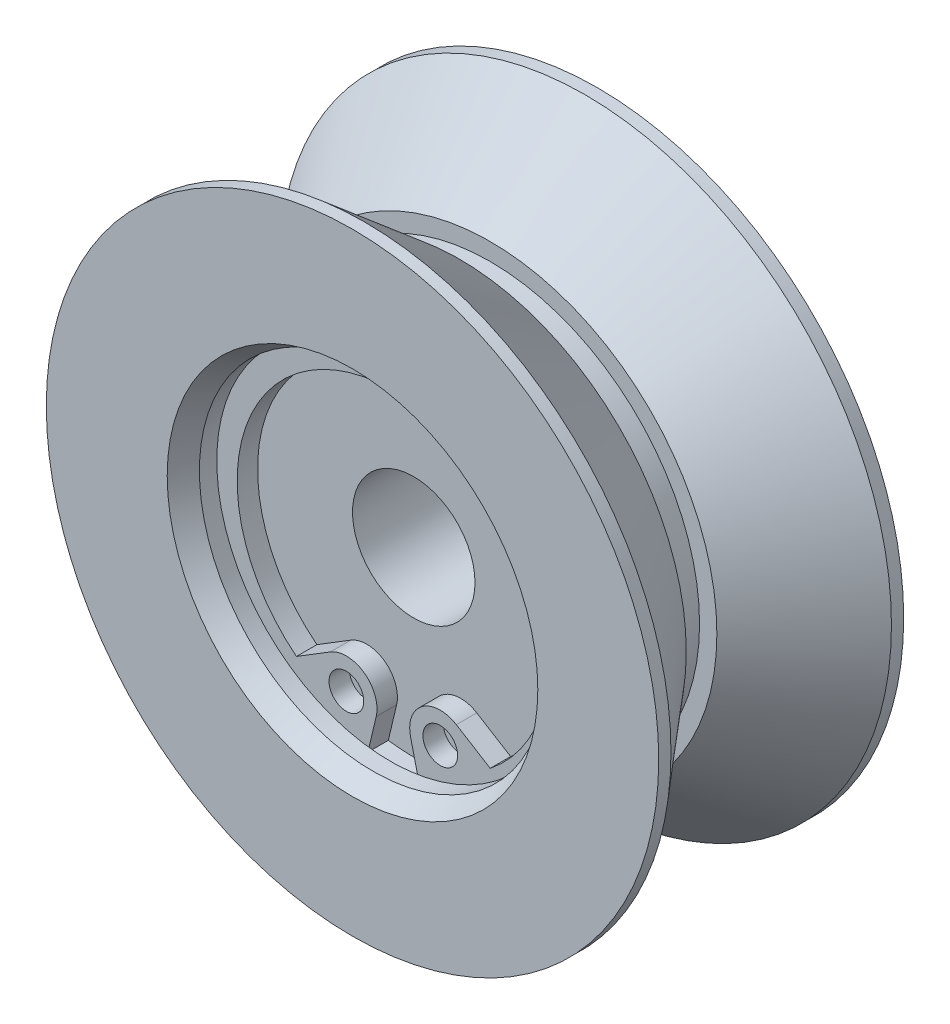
ISO-10303-21;
HEADER;
FILE_DESCRIPTION(('STEP AP214'),'2;1');
FILE_NAME('part.step','',(''),(''),'','','');
FILE_SCHEMA(('AUTOMOTIVE_DESIGN { 1 0 10303 214 1 1 1 1 }'));
ENDSEC;
DATA;
#1=APPLICATION_CONTEXT('core data for automotive mechanical design processes');
#2=APPLICATION_PROTOCOL_DEFINITION('international standard','automotive_design',2000,#1);
#3=PRODUCT_CONTEXT('',#1,'mechanical');
#4=PRODUCT('Part','Part','',(#3));
#5=PRODUCT_RELATED_PRODUCT_CATEGORY('part','',(#4));
#6=PRODUCT_DEFINITION_FORMATION('','',#4);
#7=PRODUCT_DEFINITION_CONTEXT('part definition',#1,'design');
#8=PRODUCT_DEFINITION('design','',#6,#7);
#9=PRODUCT_DEFINITION_SHAPE('','',#8);
#10=(LENGTH_UNIT() NAMED_UNIT(*) SI_UNIT(.MILLI.,.METRE.));
#11=(NAMED_UNIT(*) PLANE_ANGLE_UNIT() SI_UNIT($,.RADIAN.));
#12=(NAMED_UNIT(*) SI_UNIT($,.STERADIAN.) SOLID_ANGLE_UNIT());
#13=UNCERTAINTY_MEASURE_WITH_UNIT(LENGTH_MEASURE(1.E-05),#10,'distance_accuracy_value','');
#14=(GEOMETRIC_REPRESENTATION_CONTEXT(3) GLOBAL_UNCERTAINTY_ASSIGNED_CONTEXT((#13)) GLOBAL_UNIT_ASSIGNED_CONTEXT((#10,
#11,#12)) REPRESENTATION_CONTEXT('',''));
#15=CARTESIAN_POINT('',(0.,0.,0.));
#16=DIRECTION('',(0.,0.,1.));
#17=DIRECTION('',(1.,0.,0.));
#18=AXIS2_PLACEMENT_3D('',#15,#16,#17);
#19=CARTESIAN_POINT('',(0.,-0.5,4.));
#20=DIRECTION('',(0.,0.,1.));
#21=DIRECTION('',(-1.,0.,0.));
#22=AXIS2_PLACEMENT_3D('',#19,#20,#21);
#23=CYLINDRICAL_SURFACE('',#22,7.65);
#24=CARTESIAN_POINT('',(0.,-0.5,3.));
#25=DIRECTION('',(0.,0.,-1.));
#26=DIRECTION('',(0.,-1.,0.));
#27=AXIS2_PLACEMENT_3D('',#24,#25,#26);
#28=CIRCLE('',#27,7.65);
#29=CARTESIAN_POINT('',(-4.74513893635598,-6.50051301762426,3.));
#30=VERTEX_POINT('',#29);
#31=CARTESIAN_POINT('',(4.74513893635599,-6.50051301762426,3.));
#32=VERTEX_POINT('',#31);
#33=EDGE_CURVE('E110',#30,#32,#28,.T.);
#34=ORIENTED_EDGE('',*,*,#33,.T.);
#35=DIRECTION('',(0.,0.,-1.));
#36=VECTOR('',#35,1.);
#37=CARTESIAN_POINT('',(4.74513893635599,-6.50051301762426,4.));
#38=LINE('',#37,#36);
#39=CARTESIAN_POINT('',(4.74513893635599,-6.50051301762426,4.));
#40=VERTEX_POINT('',#39);
#41=EDGE_CURVE('E136',#40,#32,#38,.T.);
#42=ORIENTED_EDGE('',*,*,#41,.F.);
#43=CARTESIAN_POINT('',(0.,-0.5,4.));
#44=DIRECTION('',(0.,0.,-1.));
#45=DIRECTION('',(0.,-1.,0.));
#46=AXIS2_PLACEMENT_3D('',#43,#44,#45);
#47=CIRCLE('',#46,7.65);
#48=CARTESIAN_POINT('',(-4.74513893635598,-6.50051301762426,4.));
#49=VERTEX_POINT('',#48);
#50=EDGE_CURVE('E137',#49,#40,#47,.T.);
#51=ORIENTED_EDGE('',*,*,#50,.F.);
#52=DIRECTION('',(0.,0.,-1.));
#53=VECTOR('',#52,1.);
#54=CARTESIAN_POINT('',(-4.74513893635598,-6.50051301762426,4.));
#55=LINE('',#54,#53);
#56=EDGE_CURVE('E165',#49,#30,#55,.T.);
#57=ORIENTED_EDGE('',*,*,#56,.T.);
#58=EDGE_LOOP('',(#34,#42,#51,#57));
#59=FACE_BOUND('',#58,.T.);
#60=ADVANCED_FACE('F14',(#59),#23,.F.);
#61=CARTESIAN_POINT('',(3.08650226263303,-5.47917588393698,4.));
#62=DIRECTION('',(-0.524334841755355,-0.851512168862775,0.));
#63=DIRECTION('',(-0.851512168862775,0.524334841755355,0.));
#64=AXIS2_PLACEMENT_3D('',#61,#62,#63);
#65=PLANE('',#64);
#66=DIRECTION('',(-0.851512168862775,0.524334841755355,0.));
#67=VECTOR('',#66,1.);
#68=CARTESIAN_POINT('',(3.08650226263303,-5.47917588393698,3.));
#69=LINE('',#68,#67);
#70=CARTESIAN_POINT('',(3.08650226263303,-5.47917588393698,3.));
#71=VERTEX_POINT('',#70);
#72=EDGE_CURVE('E150',#32,#71,#69,.T.);
#73=ORIENTED_EDGE('',*,*,#72,.T.);
#74=DIRECTION('',(0.,0.,-1.));
#75=VECTOR('',#74,1.);
#76=CARTESIAN_POINT('',(3.08650226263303,-5.47917588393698,4.));
#77=LINE('',#76,#75);
#78=CARTESIAN_POINT('',(3.08650226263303,-5.47917588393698,4.));
#79=VERTEX_POINT('',#78);
#80=EDGE_CURVE('E145',#79,#71,#77,.T.);
#81=ORIENTED_EDGE('',*,*,#80,.F.);
#82=DIRECTION('',(-0.851512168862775,0.524334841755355,0.));
#83=VECTOR('',#82,1.);
#84=CARTESIAN_POINT('',(3.08650226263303,-5.47917588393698,4.));
#85=LINE('',#84,#83);
#86=EDGE_CURVE('E155',#40,#79,#85,.T.);
#87=ORIENTED_EDGE('',*,*,#86,.F.);
#88=ORIENTED_EDGE('',*,*,#41,.T.);
#89=EDGE_LOOP('',(#73,#81,#87,#88));
#90=FACE_BOUND('',#89,.T.);
#91=ADVANCED_FACE('F304',(#90),#65,.F.);
#92=CARTESIAN_POINT('',(2.3,-6.75644413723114,4.));
#93=DIRECTION('',(0.,0.,1.));
#94=DIRECTION('',(-1.,0.,0.));
#95=AXIS2_PLACEMENT_3D('',#92,#93,#94);
#96=CYLINDRICAL_SURFACE('',#95,1.5);
#97=CARTESIAN_POINT('',(2.3,-6.75644413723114,3.));
#98=DIRECTION('',(0.,0.,1.));
#99=DIRECTION('',(1.,0.,0.));
#100=AXIS2_PLACEMENT_3D('',#97,#98,#99);
#101=CIRCLE('',#100,1.5);
#102=CARTESIAN_POINT('',(0.840693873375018,-7.10346809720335,3.));
#103=VERTEX_POINT('',#102);
#104=EDGE_CURVE('E160',#71,#103,#101,.T.);
#105=ORIENTED_EDGE('',*,*,#104,.T.);
#106=DIRECTION('',(0.,0.,-1.));
#107=VECTOR('',#106,1.);
#108=CARTESIAN_POINT('',(0.840693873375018,-7.10346809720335,4.));
#109=LINE('',#108,#107);
#110=CARTESIAN_POINT('',(0.840693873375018,-7.10346809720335,4.));
#111=VERTEX_POINT('',#110);
#112=EDGE_CURVE('E146',#111,#103,#109,.T.);
#113=ORIENTED_EDGE('',*,*,#112,.F.);
#114=CARTESIAN_POINT('',(2.3,-6.75644413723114,4.));
#115=DIRECTION('',(0.,0.,1.));
#116=DIRECTION('',(1.,0.,0.));
#117=AXIS2_PLACEMENT_3D('',#114,#115,#116);
#118=CIRCLE('',#117,1.5);
#119=EDGE_CURVE('E151',#79,#111,#118,.T.);
#120=ORIENTED_EDGE('',*,*,#119,.F.);
#121=ORIENTED_EDGE('',*,*,#80,.T.);
#122=EDGE_LOOP('',(#105,#113,#120,#121));
#123=FACE_BOUND('',#122,.T.);
#124=ADVANCED_FACE('F250',(#123),#96,.T.);
#125=CARTESIAN_POINT('',(-0.84069387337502,-7.10346809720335,4.));
#126=DIRECTION('',(-0.97287075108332,0.231349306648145,0.));
#127=DIRECTION('',(0.,0.,1.));
#128=AXIS2_PLACEMENT_3D('',#125,#126,#127);
#129=PLANE('',#128);
#130=DIRECTION('',(0.,0.,1.));
#131=VECTOR('',#130,1.);
#132=CARTESIAN_POINT('',(-1.24703201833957,-8.81220240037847,8.6342229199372));
#133=LINE('',#132,#131);
#134=CARTESIAN_POINT('',(-1.24703201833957,-8.81220240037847,3.));
#135=VERTEX_POINT('',#134);
#136=CARTESIAN_POINT('',(-1.24703201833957,-8.81220240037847,4.));
#137=VERTEX_POINT('',#136);
#138=EDGE_CURVE('E115',#135,#137,#133,.T.);
#139=ORIENTED_EDGE('',*,*,#138,.F.);
#140=DIRECTION('',(0.231349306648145,0.97287075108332,0.));
#141=VECTOR('',#140,1.);
#142=CARTESIAN_POINT('',(-0.84069387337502,-7.10346809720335,3.));
#143=LINE('',#142,#141);
#144=CARTESIAN_POINT('',(-0.84069387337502,-7.10346809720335,3.));
#145=VERTEX_POINT('',#144);
#146=EDGE_CURVE('E103',#135,#145,#143,.T.);
#147=ORIENTED_EDGE('',*,*,#146,.T.);
#148=DIRECTION('',(0.,0.,-1.));
#149=VECTOR('',#148,1.);
#150=CARTESIAN_POINT('',(-0.84069387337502,-7.10346809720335,4.));
#151=LINE('',#150,#149);
#152=CARTESIAN_POINT('',(-0.84069387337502,-7.10346809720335,4.));
#153=VERTEX_POINT('',#152);
#154=EDGE_CURVE('E99',#153,#145,#151,.T.);
#155=ORIENTED_EDGE('',*,*,#154,.F.);
#156=DIRECTION('',(0.231349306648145,0.97287075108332,0.));
#157=VECTOR('',#156,1.);
#158=CARTESIAN_POINT('',(-0.84069387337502,-7.10346809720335,4.));
#159=LINE('',#158,#157);
#160=EDGE_CURVE('E141',#137,#153,#159,.T.);
#161=ORIENTED_EDGE('',*,*,#160,.F.);
#162=EDGE_LOOP('',(#139,#147,#155,#161));
#163=FACE_BOUND('',#162,.T.);
#164=ADVANCED_FACE('F271',(#163),#129,.F.);
#165=CARTESIAN_POINT('',(0.,-0.5,4.));
#166=DIRECTION('',(0.,0.,-1.));
#167=DIRECTION('',(0.,-1.,0.));
#168=AXIS2_PLACEMENT_3D('',#165,#166,#167);
#169=PLANE('',#168);
#170=CARTESIAN_POINT('',(2.3,-6.75644413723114,4.));
#171=DIRECTION('',(0.,0.,1.));
#172=DIRECTION('',(1.,0.,0.));
#173=AXIS2_PLACEMENT_3D('',#170,#171,#172);
#174=CIRCLE('',#173,0.85);
#175=CARTESIAN_POINT('',(3.15,-6.75644413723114,4.));
#176=VERTEX_POINT('',#175);
#177=EDGE_CURVE('E130',#176,#176,#174,.T.);
#178=ORIENTED_EDGE('',*,*,#177,.F.);
#179=EDGE_LOOP('',(#178));
#180=FACE_BOUND('',#179,.T.);
#181=CARTESIAN_POINT('',(-2.3,-6.75644413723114,4.));
#182=DIRECTION('',(0.,0.,-1.));
#183=DIRECTION('',(1.,0.,0.));
#184=AXIS2_PLACEMENT_3D('',#181,#182,#183);
#185=CIRCLE('',#184,0.85);
#186=CARTESIAN_POINT('',(-1.45,-6.75644413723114,4.));
#187=VERTEX_POINT('',#186);
#188=EDGE_CURVE('E142',#187,#187,#185,.T.);
#189=ORIENTED_EDGE('',*,*,#188,.T.);
#190=EDGE_LOOP('',(#189));
#191=FACE_BOUND('',#190,.T.);
#192=CARTESIAN_POINT('',(0.,0.,4.));
#193=DIRECTION('',(0.,0.,-1.));
#194=DIRECTION('',(-1.,0.,0.));
#195=AXIS2_PLACEMENT_3D('',#192,#193,#194);
#196=CIRCLE('',#195,8.9);
#197=CARTESIAN_POINT('',(1.24703201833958,-8.81220240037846,4.));
#198=VERTEX_POINT('',#197);
#199=EDGE_CURVE('E9',#137,#198,#196,.T.);
#200=ORIENTED_EDGE('',*,*,#199,.F.);
#201=ORIENTED_EDGE('',*,*,#160,.T.);
#202=CARTESIAN_POINT('',(-2.3,-6.75644413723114,4.));
#203=DIRECTION('',(0.,0.,1.));
#204=DIRECTION('',(-1.,0.,0.));
#205=AXIS2_PLACEMENT_3D('',#202,#203,#204);
#206=CIRCLE('',#205,1.5);
#207=CARTESIAN_POINT('',(-3.08650226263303,-5.47917588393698,4.));
#208=VERTEX_POINT('',#207);
#209=EDGE_CURVE('E138',#153,#208,#206,.T.);
#210=ORIENTED_EDGE('',*,*,#209,.T.);
#211=DIRECTION('',(-0.851512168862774,-0.524334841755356,0.));
#212=VECTOR('',#211,1.);
#213=CARTESIAN_POINT('',(-3.08650226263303,-5.47917588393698,4.));
#214=LINE('',#213,#212);
#215=EDGE_CURVE('E118',#208,#49,#214,.T.);
#216=ORIENTED_EDGE('',*,*,#215,.T.);
#217=ORIENTED_EDGE('',*,*,#50,.T.);
#218=ORIENTED_EDGE('',*,*,#86,.T.);
#219=ORIENTED_EDGE('',*,*,#119,.T.);
#220=DIRECTION('',(0.231349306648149,-0.972870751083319,0.));
#221=VECTOR('',#220,1.);
#222=CARTESIAN_POINT('',(0.840693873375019,-7.10346809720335,4.));
#223=LINE('',#222,#221);
#224=EDGE_CURVE('E156',#111,#198,#223,.T.);
#225=ORIENTED_EDGE('',*,*,#224,.T.);
#226=EDGE_LOOP('',(#200,#201,#210,#216,#217,#218,#219,#225));
#227=FACE_BOUND('',#226,.T.);
#228=ADVANCED_FACE('F267',(#180,#191,#227),#169,.F.);
#229=CARTESIAN_POINT('',(2.3,-6.75644413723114,4.));
#230=DIRECTION('',(0.,0.,1.));
#231=DIRECTION('',(-1.,0.,0.));
#232=AXIS2_PLACEMENT_3D('',#229,#230,#231);
#233=CYLINDRICAL_SURFACE('',#232,0.85);
#234=CARTESIAN_POINT('',(2.3,-6.75644413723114,3.));
#235=DIRECTION('',(0.,0.,1.));
#236=DIRECTION('',(1.,0.,0.));
#237=AXIS2_PLACEMENT_3D('',#234,#235,#236);
#238=CIRCLE('',#237,0.85);
#239=CARTESIAN_POINT('',(3.15,-6.75644413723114,3.));
#240=VERTEX_POINT('',#239);
#241=EDGE_CURVE('E120',#240,#240,#238,.T.);
#242=ORIENTED_EDGE('',*,*,#241,.F.);
#243=EDGE_LOOP('',(#242));
#244=FACE_BOUND('',#243,.T.);
#245=ORIENTED_EDGE('',*,*,#177,.T.);
#246=EDGE_LOOP('',(#245));
#247=FACE_BOUND('',#246,.T.);
#248=ADVANCED_FACE('F316',(#244,#247),#233,.F.);
#249=CARTESIAN_POINT('',(-2.3,-6.75644413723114,4.));
#250=DIRECTION('',(0.,0.,1.));
#251=DIRECTION('',(-1.,0.,0.));
#252=AXIS2_PLACEMENT_3D('',#249,#250,#251);
#253=CYLINDRICAL_SURFACE('',#252,0.85);
#254=CARTESIAN_POINT('',(-2.3,-6.75644413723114,3.));
#255=DIRECTION('',(0.,0.,-1.));
#256=DIRECTION('',(1.,0.,0.));
#257=AXIS2_PLACEMENT_3D('',#254,#255,#256);
#258=CIRCLE('',#257,0.85);
#259=CARTESIAN_POINT('',(-1.45,-6.75644413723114,3.));
#260=VERTEX_POINT('',#259);
#261=EDGE_CURVE('E133',#260,#260,#258,.T.);
#262=ORIENTED_EDGE('',*,*,#261,.T.);
#263=EDGE_LOOP('',(#262));
#264=FACE_BOUND('',#263,.T.);
#265=ORIENTED_EDGE('',*,*,#188,.F.);
#266=EDGE_LOOP('',(#265));
#267=FACE_BOUND('',#266,.T.);
#268=ADVANCED_FACE('F506',(#264,#267),#253,.F.);
#269=CARTESIAN_POINT('',(-3.08650226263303,-5.47917588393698,4.));
#270=DIRECTION('',(0.524334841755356,-0.851512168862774,0.));
#271=DIRECTION('',(0.,0.,-1.));
#272=AXIS2_PLACEMENT_3D('',#269,#270,#271);
#273=PLANE('',#272);
#274=DIRECTION('',(-0.851512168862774,-0.524334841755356,0.));
#275=VECTOR('',#274,1.);
#276=CARTESIAN_POINT('',(-3.08650226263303,-5.47917588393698,3.));
#277=LINE('',#276,#275);
#278=CARTESIAN_POINT('',(-3.08650226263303,-5.47917588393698,3.));
#279=VERTEX_POINT('',#278);
#280=EDGE_CURVE('E106',#279,#30,#277,.T.);
#281=ORIENTED_EDGE('',*,*,#280,.T.);
#282=ORIENTED_EDGE('',*,*,#56,.F.);
#283=ORIENTED_EDGE('',*,*,#215,.F.);
#284=DIRECTION('',(0.,0.,-1.));
#285=VECTOR('',#284,1.);
#286=CARTESIAN_POINT('',(-3.08650226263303,-5.47917588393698,4.));
#287=LINE('',#286,#285);
#288=EDGE_CURVE('E96',#208,#279,#287,.T.);
#289=ORIENTED_EDGE('',*,*,#288,.T.);
#290=EDGE_LOOP('',(#281,#282,#283,#289));
#291=FACE_BOUND('',#290,.T.);
#292=ADVANCED_FACE('F117',(#291),#273,.F.);
#293=CARTESIAN_POINT('',(-2.3,-6.75644413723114,4.));
#294=DIRECTION('',(0.,0.,1.));
#295=DIRECTION('',(-1.,0.,0.));
#296=AXIS2_PLACEMENT_3D('',#293,#294,#295);
#297=CYLINDRICAL_SURFACE('',#296,1.5);
#298=CARTESIAN_POINT('',(-2.3,-6.75644413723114,3.));
#299=DIRECTION('',(0.,0.,1.));
#300=DIRECTION('',(-1.,0.,0.));
#301=AXIS2_PLACEMENT_3D('',#298,#299,#300);
#302=CIRCLE('',#301,1.5);
#303=EDGE_CURVE('E91',#145,#279,#302,.T.);
#304=ORIENTED_EDGE('',*,*,#303,.T.);
#305=ORIENTED_EDGE('',*,*,#288,.F.);
#306=ORIENTED_EDGE('',*,*,#209,.F.);
#307=ORIENTED_EDGE('',*,*,#154,.T.);
#308=EDGE_LOOP('',(#304,#305,#306,#307));
#309=FACE_BOUND('',#308,.T.);
#310=ADVANCED_FACE('F93',(#309),#297,.T.);
#311=CARTESIAN_POINT('',(0.840693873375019,-7.10346809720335,4.));
#312=DIRECTION('',(0.972870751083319,0.231349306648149,0.));
#313=DIRECTION('',(0.,0.,-1.));
#314=AXIS2_PLACEMENT_3D('',#311,#312,#313);
#315=PLANE('',#314);
#316=DIRECTION('',(0.,0.,1.));
#317=VECTOR('',#316,1.);
#318=CARTESIAN_POINT('',(1.24703201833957,-8.81220240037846,8.6342229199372));
#319=LINE('',#318,#317);
#320=CARTESIAN_POINT('',(1.24703201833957,-8.81220240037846,3.));
#321=VERTEX_POINT('',#320);
#322=EDGE_CURVE('E18',#198,#321,#319,.F.);
#323=ORIENTED_EDGE('',*,*,#322,.F.);
#324=ORIENTED_EDGE('',*,*,#224,.F.);
#325=ORIENTED_EDGE('',*,*,#112,.T.);
#326=DIRECTION('',(0.231349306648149,-0.972870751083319,0.));
#327=VECTOR('',#326,1.);
#328=CARTESIAN_POINT('',(0.840693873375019,-7.10346809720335,3.));
#329=LINE('',#328,#327);
#330=EDGE_CURVE('E32',#103,#321,#329,.T.);
#331=ORIENTED_EDGE('',*,*,#330,.T.);
#332=EDGE_LOOP('',(#323,#324,#325,#331));
#333=FACE_BOUND('',#332,.T.);
#334=ADVANCED_FACE('F253',(#333),#315,.F.);
#335=CARTESIAN_POINT('',(0.,3.,3.));
#336=DIRECTION('',(0.,0.,-1.));
#337=DIRECTION('',(-1.,0.,0.));
#338=AXIS2_PLACEMENT_3D('',#335,#336,#337);
#339=PLANE('',#338);
#340=ORIENTED_EDGE('',*,*,#241,.T.);
#341=EDGE_LOOP('',(#340));
#342=FACE_BOUND('',#341,.T.);
#343=ADVANCED_FACE('F290',(#342),#339,.F.);
#344=ORIENTED_EDGE('',*,*,#261,.F.);
#345=EDGE_LOOP('',(#344));
#346=FACE_BOUND('',#345,.T.);
#347=ADVANCED_FACE('F292',(#346),#339,.F.);
#348=CARTESIAN_POINT('',(0.,0.,8.6342229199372));
#349=DIRECTION('',(0.,0.,1.));
#350=DIRECTION('',(1.,0.,0.));
#351=AXIS2_PLACEMENT_3D('',#348,#349,#350);
#352=CYLINDRICAL_SURFACE('',#351,10.25);
#353=CARTESIAN_POINT('',(0.,0.,0.75));
#354=DIRECTION('',(0.,0.,1.));
#355=DIRECTION('',(1.,0.,0.));
#356=AXIS2_PLACEMENT_3D('',#353,#354,#355);
#357=CIRCLE('',#356,10.25);
#358=CARTESIAN_POINT('',(10.25,0.,0.75));
#359=VERTEX_POINT('',#358);
#360=EDGE_CURVE('E210',#359,#359,#357,.T.);
#361=ORIENTED_EDGE('',*,*,#360,.F.);
#362=EDGE_LOOP('',(#361));
#363=FACE_BOUND('',#362,.T.);
#364=CARTESIAN_POINT('',(0.,0.,-0.75));
#365=DIRECTION('',(0.,0.,1.));
#366=DIRECTION('',(1.,0.,0.));
#367=AXIS2_PLACEMENT_3D('',#364,#365,#366);
#368=CIRCLE('',#367,10.25);
#369=CARTESIAN_POINT('',(10.25,0.,-0.75));
#370=VERTEX_POINT('',#369);
#371=EDGE_CURVE('E213',#370,#370,#368,.T.);
#372=ORIENTED_EDGE('',*,*,#371,.T.);
#373=EDGE_LOOP('',(#372));
#374=FACE_BOUND('',#373,.T.);
#375=ADVANCED_FACE('F298',(#363,#374),#352,.T.);
#376=CARTESIAN_POINT('',(0.,10.25,0.75));
#377=DIRECTION('',(0.,0.,1.));
#378=DIRECTION('',(1.,0.,0.));
#379=AXIS2_PLACEMENT_3D('',#376,#377,#378);
#380=PLANE('',#379);
#381=CARTESIAN_POINT('',(0.,0.,0.75));
#382=DIRECTION('',(0.,0.,1.));
#383=DIRECTION('',(1.,0.,0.));
#384=AXIS2_PLACEMENT_3D('',#381,#382,#383);
#385=CIRCLE('',#384,11.0981867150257);
#386=CARTESIAN_POINT('',(11.0981867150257,0.,0.75));
#387=VERTEX_POINT('',#386);
#388=EDGE_CURVE('E207',#387,#387,#385,.T.);
#389=ORIENTED_EDGE('',*,*,#388,.F.);
#390=EDGE_LOOP('',(#389));
#391=FACE_BOUND('',#390,.T.);
#392=ORIENTED_EDGE('',*,*,#360,.T.);
#393=EDGE_LOOP('',(#392));
#394=FACE_BOUND('',#393,.T.);
#395=ADVANCED_FACE('F365',(#391,#394),#380,.F.);
#396=CARTESIAN_POINT('',(0.,10.25,-0.75));
#397=DIRECTION('',(0.,0.,-1.));
#398=DIRECTION('',(-1.,0.,0.));
#399=AXIS2_PLACEMENT_3D('',#396,#397,#398);
#400=PLANE('',#399);
#401=ORIENTED_EDGE('',*,*,#371,.F.);
#402=EDGE_LOOP('',(#401));
#403=FACE_BOUND('',#402,.T.);
#404=CARTESIAN_POINT('',(0.,0.,-0.75));
#405=DIRECTION('',(0.,0.,1.));
#406=DIRECTION('',(1.,0.,0.));
#407=AXIS2_PLACEMENT_3D('',#404,#405,#406);
#408=CIRCLE('',#407,11.0981867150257);
#409=CARTESIAN_POINT('',(11.0981867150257,0.,-0.75));
#410=VERTEX_POINT('',#409);
#411=EDGE_CURVE('E216',#410,#410,#408,.T.);
#412=ORIENTED_EDGE('',*,*,#411,.T.);
#413=EDGE_LOOP('',(#412));
#414=FACE_BOUND('',#413,.T.);
#415=ADVANCED_FACE('F363',(#403,#414),#400,.F.);
#416=CARTESIAN_POINT('',(0.,0.,0.75));
#417=DIRECTION('',(0.,0.,1.));
#418=DIRECTION('',(1.,0.,0.));
#419=AXIS2_PLACEMENT_3D('',#416,#417,#418);
#420=CONICAL_SURFACE('',#419,11.0981867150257,0.69813170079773);
#421=CARTESIAN_POINT('',(0.,0.,5.4));
#422=DIRECTION('',(0.,0.,1.));
#423=DIRECTION('',(1.,0.,0.));
#424=AXIS2_PLACEMENT_3D('',#421,#422,#423);
#425=CIRCLE('',#424,15.);
#426=CARTESIAN_POINT('',(15.,0.,5.4));
#427=VERTEX_POINT('',#426);
#428=EDGE_CURVE('E204',#427,#427,#425,.T.);
#429=ORIENTED_EDGE('',*,*,#428,.F.);
#430=EDGE_LOOP('',(#429));
#431=FACE_BOUND('',#430,.T.);
#432=ORIENTED_EDGE('',*,*,#388,.T.);
#433=EDGE_LOOP('',(#432));
#434=FACE_BOUND('',#433,.T.);
#435=ADVANCED_FACE('F360',(#431,#434),#420,.T.);
#436=CARTESIAN_POINT('',(0.,0.,-5.4));
#437=DIRECTION('',(0.,0.,-1.));
#438=DIRECTION('',(-1.,0.,0.));
#439=AXIS2_PLACEMENT_3D('',#436,#437,#438);
#440=CONICAL_SURFACE('',#439,15.,0.69813170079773);
#441=ORIENTED_EDGE('',*,*,#411,.F.);
#442=EDGE_LOOP('',(#441));
#443=FACE_BOUND('',#442,.T.);
#444=CARTESIAN_POINT('',(0.,0.,-5.4));
#445=DIRECTION('',(0.,0.,1.));
#446=DIRECTION('',(1.,0.,0.));
#447=AXIS2_PLACEMENT_3D('',#444,#445,#446);
#448=CIRCLE('',#447,15.);
#449=CARTESIAN_POINT('',(15.,0.,-5.4));
#450=VERTEX_POINT('',#449);
#451=EDGE_CURVE('E219',#450,#450,#448,.T.);
#452=ORIENTED_EDGE('',*,*,#451,.T.);
#453=EDGE_LOOP('',(#452));
#454=FACE_BOUND('',#453,.T.);
#455=ADVANCED_FACE('F358',(#443,#454),#440,.T.);
#456=CARTESIAN_POINT('',(0.,0.,8.6342229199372));
#457=DIRECTION('',(0.,0.,1.));
#458=DIRECTION('',(1.,0.,0.));
#459=AXIS2_PLACEMENT_3D('',#456,#457,#458);
#460=CYLINDRICAL_SURFACE('',#459,15.);
#461=CARTESIAN_POINT('',(0.,0.,6.));
#462=DIRECTION('',(0.,0.,1.));
#463=DIRECTION('',(1.,0.,0.));
#464=AXIS2_PLACEMENT_3D('',#461,#462,#463);
#465=CIRCLE('',#464,15.);
#466=CARTESIAN_POINT('',(15.,0.,6.));
#467=VERTEX_POINT('',#466);
#468=EDGE_CURVE('E201',#467,#467,#465,.T.);
#469=ORIENTED_EDGE('',*,*,#468,.F.);
#470=EDGE_LOOP('',(#469));
#471=FACE_BOUND('',#470,.T.);
#472=ORIENTED_EDGE('',*,*,#428,.T.);
#473=EDGE_LOOP('',(#472));
#474=FACE_BOUND('',#473,.T.);
#475=ADVANCED_FACE('F355',(#471,#474),#460,.T.);
#476=CARTESIAN_POINT('',(0.,0.,8.6342229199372));
#477=DIRECTION('',(0.,0.,1.));
#478=DIRECTION('',(1.,0.,0.));
#479=AXIS2_PLACEMENT_3D('',#476,#477,#478);
#480=CYLINDRICAL_SURFACE('',#479,15.);
#481=ORIENTED_EDGE('',*,*,#451,.F.);
#482=EDGE_LOOP('',(#481));
#483=FACE_BOUND('',#482,.T.);
#484=CARTESIAN_POINT('',(0.,0.,-6.));
#485=DIRECTION('',(0.,0.,1.));
#486=DIRECTION('',(1.,0.,0.));
#487=AXIS2_PLACEMENT_3D('',#484,#485,#486);
#488=CIRCLE('',#487,15.);
#489=CARTESIAN_POINT('',(15.,0.,-6.));
#490=VERTEX_POINT('',#489);
#491=EDGE_CURVE('E172',#490,#490,#488,.T.);
#492=ORIENTED_EDGE('',*,*,#491,.T.);
#493=EDGE_LOOP('',(#492));
#494=FACE_BOUND('',#493,.T.);
#495=ADVANCED_FACE('F16',(#483,#494),#480,.T.);
#496=CARTESIAN_POINT('',(0.,15.,6.));
#497=DIRECTION('',(0.,0.,-1.));
#498=DIRECTION('',(-1.,0.,0.));
#499=AXIS2_PLACEMENT_3D('',#496,#497,#498);
#500=PLANE('',#499);
#501=CARTESIAN_POINT('',(0.,0.,6.));
#502=DIRECTION('',(0.,0.,1.));
#503=DIRECTION('',(1.,0.,0.));
#504=AXIS2_PLACEMENT_3D('',#501,#502,#503);
#505=CIRCLE('',#504,9.07735026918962);
#506=CARTESIAN_POINT('',(9.07735026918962,0.,6.));
#507=VERTEX_POINT('',#506);
#508=EDGE_CURVE('E198',#507,#507,#505,.T.);
#509=ORIENTED_EDGE('',*,*,#508,.F.);
#510=EDGE_LOOP('',(#509));
#511=FACE_BOUND('',#510,.T.);
#512=ORIENTED_EDGE('',*,*,#468,.T.);
#513=EDGE_LOOP('',(#512));
#514=FACE_BOUND('',#513,.T.);
#515=ADVANCED_FACE('F324',(#511,#514),#500,.F.);
#516=CARTESIAN_POINT('',(0.,6.5,-6.));
#517=DIRECTION('',(0.,0.,1.));
#518=DIRECTION('',(1.,0.,0.));
#519=AXIS2_PLACEMENT_3D('',#516,#517,#518);
#520=PLANE('',#519);
#521=ORIENTED_EDGE('',*,*,#491,.F.);
#522=EDGE_LOOP('',(#521));
#523=FACE_BOUND('',#522,.T.);
#524=CARTESIAN_POINT('',(0.,0.,-6.));
#525=DIRECTION('',(0.,0.,1.));
#526=DIRECTION('',(1.,0.,0.));
#527=AXIS2_PLACEMENT_3D('',#524,#525,#526);
#528=CIRCLE('',#527,6.5);
#529=CARTESIAN_POINT('',(6.5,0.,-6.));
#530=VERTEX_POINT('',#529);
#531=EDGE_CURVE('E175',#530,#530,#528,.T.);
#532=ORIENTED_EDGE('',*,*,#531,.T.);
#533=EDGE_LOOP('',(#532));
#534=FACE_BOUND('',#533,.T.);
#535=ADVANCED_FACE('F320',(#523,#534),#520,.F.);
#536=CARTESIAN_POINT('',(0.,0.,6.));
#537=DIRECTION('',(0.,0.,1.));
#538=DIRECTION('',(1.,0.,0.));
#539=AXIS2_PLACEMENT_3D('',#536,#537,#538);
#540=CONICAL_SURFACE('',#539,9.07735026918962,0.523598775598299);
#541=CARTESIAN_POINT('',(0.,0.,5.));
#542=DIRECTION('',(0.,0.,1.));
#543=DIRECTION('',(1.,0.,0.));
#544=AXIS2_PLACEMENT_3D('',#541,#542,#543);
#545=CIRCLE('',#544,8.5);
#546=CARTESIAN_POINT('',(8.5,0.,5.));
#547=VERTEX_POINT('',#546);
#548=EDGE_CURVE('E195',#547,#547,#545,.T.);
#549=ORIENTED_EDGE('',*,*,#548,.F.);
#550=EDGE_LOOP('',(#549));
#551=FACE_BOUND('',#550,.T.);
#552=ORIENTED_EDGE('',*,*,#508,.T.);
#553=EDGE_LOOP('',(#552));
#554=FACE_BOUND('',#553,.T.);
#555=ADVANCED_FACE('F323',(#551,#554),#540,.F.);
#556=CARTESIAN_POINT('',(0.,0.,8.6342229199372));
#557=DIRECTION('',(0.,0.,1.));
#558=DIRECTION('',(1.,0.,0.));
#559=AXIS2_PLACEMENT_3D('',#556,#557,#558);
#560=CYLINDRICAL_SURFACE('',#559,6.5);
#561=ORIENTED_EDGE('',*,*,#531,.F.);
#562=EDGE_LOOP('',(#561));
#563=FACE_BOUND('',#562,.T.);
#564=CARTESIAN_POINT('',(0.,0.,-3.));
#565=DIRECTION('',(0.,0.,1.));
#566=DIRECTION('',(1.,0.,0.));
#567=AXIS2_PLACEMENT_3D('',#564,#565,#566);
#568=CIRCLE('',#567,6.5);
#569=CARTESIAN_POINT('',(6.5,0.,-3.));
#570=VERTEX_POINT('',#569);
#571=EDGE_CURVE('E178',#570,#570,#568,.T.);
#572=ORIENTED_EDGE('',*,*,#571,.T.);
#573=EDGE_LOOP('',(#572));
#574=FACE_BOUND('',#573,.T.);
#575=ADVANCED_FACE('F326',(#563,#574),#560,.F.);
#576=CARTESIAN_POINT('',(0.,0.,8.6342229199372));
#577=DIRECTION('',(0.,0.,1.));
#578=DIRECTION('',(1.,0.,0.));
#579=AXIS2_PLACEMENT_3D('',#576,#577,#578);
#580=CYLINDRICAL_SURFACE('',#579,8.5);
#581=CARTESIAN_POINT('',(0.,0.,4.15));
#582=DIRECTION('',(0.,0.,1.));
#583=DIRECTION('',(1.,0.,0.));
#584=AXIS2_PLACEMENT_3D('',#581,#582,#583);
#585=CIRCLE('',#584,8.5);
#586=CARTESIAN_POINT('',(8.5,0.,4.15));
#587=VERTEX_POINT('',#586);
#588=EDGE_CURVE('E192',#587,#587,#585,.T.);
#589=ORIENTED_EDGE('',*,*,#588,.F.);
#590=EDGE_LOOP('',(#589));
#591=FACE_BOUND('',#590,.T.);
#592=ORIENTED_EDGE('',*,*,#548,.T.);
#593=EDGE_LOOP('',(#592));
#594=FACE_BOUND('',#593,.T.);
#595=ADVANCED_FACE('F329',(#591,#594),#580,.F.);
#596=CARTESIAN_POINT('',(0.,6.5,-3.));
#597=DIRECTION('',(0.,0.,1.));
#598=DIRECTION('',(1.,0.,0.));
#599=AXIS2_PLACEMENT_3D('',#596,#597,#598);
#600=PLANE('',#599);
#601=ORIENTED_EDGE('',*,*,#571,.F.);
#602=EDGE_LOOP('',(#601));
#603=FACE_BOUND('',#602,.T.);
#604=CARTESIAN_POINT('',(0.,0.,-3.));
#605=DIRECTION('',(0.,0.,1.));
#606=DIRECTION('',(1.,0.,0.));
#607=AXIS2_PLACEMENT_3D('',#604,#605,#606);
#608=CIRCLE('',#607,3.);
#609=CARTESIAN_POINT('',(3.,0.,-3.));
#610=VERTEX_POINT('',#609);
#611=EDGE_CURVE('E181',#610,#610,#608,.T.);
#612=ORIENTED_EDGE('',*,*,#611,.T.);
#613=EDGE_LOOP('',(#612));
#614=FACE_BOUND('',#613,.T.);
#615=ADVANCED_FACE('F286',(#603,#614),#600,.F.);
#616=CARTESIAN_POINT('',(0.,8.9,4.15));
#617=DIRECTION('',(0.,0.,1.));
#618=DIRECTION('',(1.,0.,0.));
#619=AXIS2_PLACEMENT_3D('',#616,#617,#618);
#620=PLANE('',#619);
#621=CARTESIAN_POINT('',(0.,0.,4.15));
#622=DIRECTION('',(0.,0.,1.));
#623=DIRECTION('',(1.,0.,0.));
#624=AXIS2_PLACEMENT_3D('',#621,#622,#623);
#625=CIRCLE('',#624,8.9);
#626=CARTESIAN_POINT('',(8.9,0.,4.15));
#627=VERTEX_POINT('',#626);
#628=EDGE_CURVE('E189',#627,#627,#625,.T.);
#629=ORIENTED_EDGE('',*,*,#628,.F.);
#630=EDGE_LOOP('',(#629));
#631=FACE_BOUND('',#630,.T.);
#632=ORIENTED_EDGE('',*,*,#588,.T.);
#633=EDGE_LOOP('',(#632));
#634=FACE_BOUND('',#633,.T.);
#635=ADVANCED_FACE('F276',(#631,#634),#620,.F.);
#636=CARTESIAN_POINT('',(0.,0.,8.6342229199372));
#637=DIRECTION('',(0.,0.,1.));
#638=DIRECTION('',(1.,0.,0.));
#639=AXIS2_PLACEMENT_3D('',#636,#637,#638);
#640=CYLINDRICAL_SURFACE('',#639,8.9);
#641=ORIENTED_EDGE('',*,*,#628,.T.);
#642=EDGE_LOOP('',(#641));
#643=FACE_BOUND('',#642,.T.);
#644=ORIENTED_EDGE('',*,*,#199,.T.);
#645=ORIENTED_EDGE('',*,*,#322,.T.);
#646=CARTESIAN_POINT('',(0.,0.,3.));
#647=DIRECTION('',(0.,0.,1.));
#648=DIRECTION('',(1.,0.,0.));
#649=AXIS2_PLACEMENT_3D('',#646,#647,#648);
#650=CIRCLE('',#649,8.9);
#651=EDGE_CURVE('E187',#135,#321,#650,.T.);
#652=ORIENTED_EDGE('',*,*,#651,.F.);
#653=ORIENTED_EDGE('',*,*,#138,.T.);
#654=EDGE_LOOP('',(#644,#645,#652,#653));
#655=FACE_BOUND('',#654,.T.);
#656=ADVANCED_FACE('F273',(#643,#655),#640,.F.);
#657=CARTESIAN_POINT('',(0.,0.,8.6342229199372));
#658=DIRECTION('',(0.,0.,1.));
#659=DIRECTION('',(1.,0.,0.));
#660=AXIS2_PLACEMENT_3D('',#657,#658,#659);
#661=CYLINDRICAL_SURFACE('',#660,3.);
#662=ORIENTED_EDGE('',*,*,#611,.F.);
#663=EDGE_LOOP('',(#662));
#664=FACE_BOUND('',#663,.T.);
#665=CARTESIAN_POINT('',(0.,0.,3.));
#666=DIRECTION('',(0.,0.,1.));
#667=DIRECTION('',(1.,0.,0.));
#668=AXIS2_PLACEMENT_3D('',#665,#666,#667);
#669=CIRCLE('',#668,3.);
#670=CARTESIAN_POINT('',(3.,0.,3.));
#671=VERTEX_POINT('',#670);
#672=EDGE_CURVE('E184',#671,#671,#669,.T.);
#673=ORIENTED_EDGE('',*,*,#672,.T.);
#674=EDGE_LOOP('',(#673));
#675=FACE_BOUND('',#674,.T.);
#676=ADVANCED_FACE('F275',(#664,#675),#661,.F.);
#677=ORIENTED_EDGE('',*,*,#672,.F.);
#678=EDGE_LOOP('',(#677));
#679=FACE_BOUND('',#678,.T.);
#680=ORIENTED_EDGE('',*,*,#651,.T.);
#681=ORIENTED_EDGE('',*,*,#330,.F.);
#682=ORIENTED_EDGE('',*,*,#104,.F.);
#683=ORIENTED_EDGE('',*,*,#72,.F.);
#684=ORIENTED_EDGE('',*,*,#33,.F.);
#685=ORIENTED_EDGE('',*,*,#280,.F.);
#686=ORIENTED_EDGE('',*,*,#303,.F.);
#687=ORIENTED_EDGE('',*,*,#146,.F.);
#688=EDGE_LOOP('',(#680,#681,#682,#683,#684,#685,#686,#687));
#689=FACE_BOUND('',#688,.T.);
#690=ADVANCED_FACE('F108',(#679,#689),#339,.F.);
#691=CLOSED_SHELL('',(#60,#91,#124,#164,#228,#248,#268,#292,#310,#334,#343,#347,#375,#395,#415,
#435,#455,#475,#495,#515,#535,#555,#575,#595,#615,#635,#656,#676,#690));
#692=MANIFOLD_SOLID_BREP('B1',#691);
#693=ADVANCED_BREP_SHAPE_REPRESENTATION('',(#18,#692),#14);
#694=SHAPE_DEFINITION_REPRESENTATION(#9,#693);
ENDSEC;
END-ISO-10303-21;
